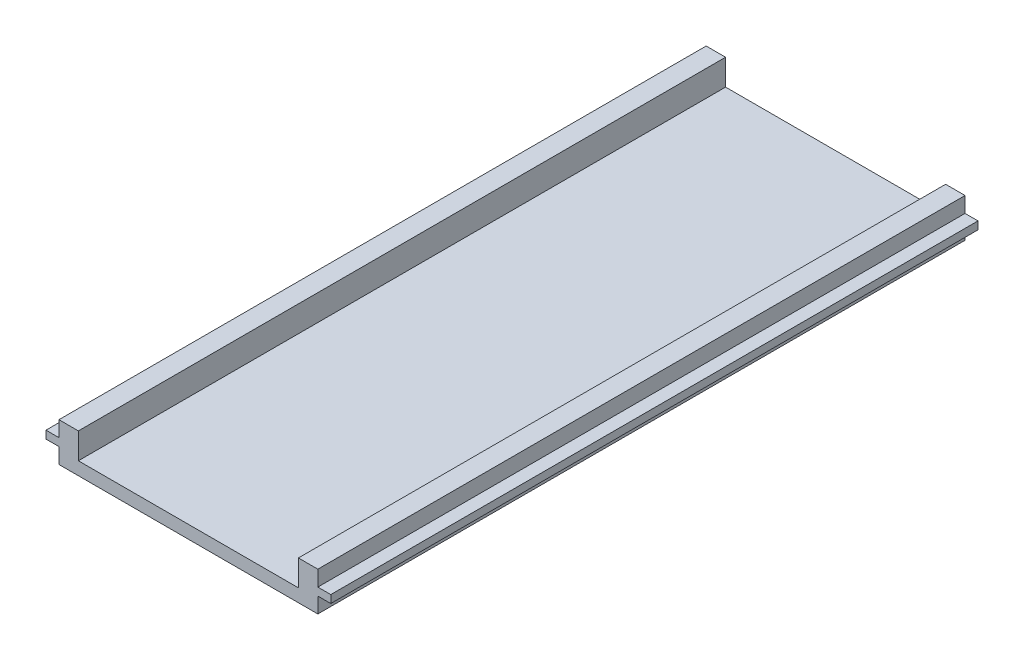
ISO-10303-21;
HEADER;
FILE_DESCRIPTION(('STEP AP214'),'2;1');
FILE_NAME('part.step','',(''),(''),'','','');
FILE_SCHEMA(('AUTOMOTIVE_DESIGN { 1 0 10303 214 1 1 1 1 }'));
ENDSEC;
DATA;
#1=APPLICATION_CONTEXT('core data for automotive mechanical design processes');
#2=APPLICATION_PROTOCOL_DEFINITION('international standard','automotive_design',2000,#1);
#3=PRODUCT_CONTEXT('',#1,'mechanical');
#4=PRODUCT('Part','Part','',(#3));
#5=PRODUCT_RELATED_PRODUCT_CATEGORY('part','',(#4));
#6=PRODUCT_DEFINITION_FORMATION('','',#4);
#7=PRODUCT_DEFINITION_CONTEXT('part definition',#1,'design');
#8=PRODUCT_DEFINITION('design','',#6,#7);
#9=PRODUCT_DEFINITION_SHAPE('','',#8);
#10=(LENGTH_UNIT() NAMED_UNIT(*) SI_UNIT(.MILLI.,.METRE.));
#11=(NAMED_UNIT(*) PLANE_ANGLE_UNIT() SI_UNIT($,.RADIAN.));
#12=(NAMED_UNIT(*) SI_UNIT($,.STERADIAN.) SOLID_ANGLE_UNIT());
#13=UNCERTAINTY_MEASURE_WITH_UNIT(LENGTH_MEASURE(1.E-05),#10,'distance_accuracy_value','');
#14=(GEOMETRIC_REPRESENTATION_CONTEXT(3) GLOBAL_UNCERTAINTY_ASSIGNED_CONTEXT((#13)) GLOBAL_UNIT_ASSIGNED_CONTEXT((#10,
#11,#12)) REPRESENTATION_CONTEXT('',''));
#15=CARTESIAN_POINT('',(0.,0.,0.));
#16=DIRECTION('',(0.,0.,1.));
#17=DIRECTION('',(1.,0.,0.));
#18=AXIS2_PLACEMENT_3D('',#15,#16,#17);
#19=CARTESIAN_POINT('',(4.73196112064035,0.,50.));
#20=DIRECTION('',(1.,0.,0.));
#21=DIRECTION('',(0.,0.,-1.));
#22=AXIS2_PLACEMENT_3D('',#19,#20,#21);
#23=PLANE('',#22);
#24=DIRECTION('',(0.,-1.,0.));
#25=VECTOR('',#24,1.);
#26=CARTESIAN_POINT('',(4.73196112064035,0.,0.));
#27=LINE('',#26,#25);
#28=CARTESIAN_POINT('',(4.73196112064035,1.2,0.));
#29=VERTEX_POINT('',#28);
#30=CARTESIAN_POINT('',(4.73196112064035,0.,0.));
#31=VERTEX_POINT('',#30);
#32=EDGE_CURVE('E179',#29,#31,#27,.T.);
#33=ORIENTED_EDGE('',*,*,#32,.T.);
#34=DIRECTION('',(0.,0.,-1.));
#35=VECTOR('',#34,1.);
#36=CARTESIAN_POINT('',(4.73196112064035,0.,50.));
#37=LINE('',#36,#35);
#38=CARTESIAN_POINT('',(4.73196112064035,0.,50.));
#39=VERTEX_POINT('',#38);
#40=EDGE_CURVE('E11',#39,#31,#37,.T.);
#41=ORIENTED_EDGE('',*,*,#40,.F.);
#42=DIRECTION('',(0.,-1.,0.));
#43=VECTOR('',#42,1.);
#44=CARTESIAN_POINT('',(4.73196112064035,0.,50.));
#45=LINE('',#44,#43);
#46=CARTESIAN_POINT('',(4.73196112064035,1.2,50.));
#47=VERTEX_POINT('',#46);
#48=EDGE_CURVE('E209',#47,#39,#45,.T.);
#49=ORIENTED_EDGE('',*,*,#48,.F.);
#50=DIRECTION('',(0.,0.,-1.));
#51=VECTOR('',#50,1.);
#52=CARTESIAN_POINT('',(4.73196112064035,1.2,50.));
#53=LINE('',#52,#51);
#54=EDGE_CURVE('E175',#47,#29,#53,.T.);
#55=ORIENTED_EDGE('',*,*,#54,.T.);
#56=EDGE_LOOP('',(#33,#41,#49,#55));
#57=FACE_BOUND('',#56,.T.);
#58=ADVANCED_FACE('F35',(#57),#23,.F.);
#59=CARTESIAN_POINT('',(4.73196112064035,0.,50.));
#60=DIRECTION('',(0.,1.,0.));
#61=DIRECTION('',(0.,0.,1.));
#62=AXIS2_PLACEMENT_3D('',#59,#60,#61);
#63=PLANE('',#62);
#64=DIRECTION('',(1.,0.,0.));
#65=VECTOR('',#64,1.);
#66=CARTESIAN_POINT('',(4.73196112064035,0.,0.));
#67=LINE('',#66,#65);
#68=CARTESIAN_POINT('',(24.7319611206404,0.,0.));
#69=VERTEX_POINT('',#68);
#70=EDGE_CURVE('E182',#31,#69,#67,.T.);
#71=ORIENTED_EDGE('',*,*,#70,.T.);
#72=DIRECTION('',(0.,0.,-1.));
#73=VECTOR('',#72,1.);
#74=CARTESIAN_POINT('',(24.7319611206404,0.,50.));
#75=LINE('',#74,#73);
#76=CARTESIAN_POINT('',(24.7319611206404,0.,50.));
#77=VERTEX_POINT('',#76);
#78=EDGE_CURVE('E43',#77,#69,#75,.T.);
#79=ORIENTED_EDGE('',*,*,#78,.F.);
#80=DIRECTION('',(1.,0.,0.));
#81=VECTOR('',#80,1.);
#82=CARTESIAN_POINT('',(4.73196112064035,0.,50.));
#83=LINE('',#82,#81);
#84=EDGE_CURVE('E118',#39,#77,#83,.T.);
#85=ORIENTED_EDGE('',*,*,#84,.F.);
#86=ORIENTED_EDGE('',*,*,#40,.T.);
#87=EDGE_LOOP('',(#71,#79,#85,#86));
#88=FACE_BOUND('',#87,.T.);
#89=ADVANCED_FACE('F307',(#88),#63,.F.);
#90=CARTESIAN_POINT('',(24.7319611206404,0.,50.));
#91=DIRECTION('',(-1.,0.,0.));
#92=DIRECTION('',(0.,0.,1.));
#93=AXIS2_PLACEMENT_3D('',#90,#91,#92);
#94=PLANE('',#93);
#95=DIRECTION('',(0.,1.,0.));
#96=VECTOR('',#95,1.);
#97=CARTESIAN_POINT('',(24.7319611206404,0.,0.));
#98=LINE('',#97,#96);
#99=CARTESIAN_POINT('',(24.7319611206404,1.2,0.));
#100=VERTEX_POINT('',#99);
#101=EDGE_CURVE('E184',#69,#100,#98,.T.);
#102=ORIENTED_EDGE('',*,*,#101,.T.);
#103=DIRECTION('',(0.,0.,-1.));
#104=VECTOR('',#103,1.);
#105=CARTESIAN_POINT('',(24.7319611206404,1.2,50.));
#106=LINE('',#105,#104);
#107=CARTESIAN_POINT('',(24.7319611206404,1.2,50.));
#108=VERTEX_POINT('',#107);
#109=EDGE_CURVE('E240',#108,#100,#106,.T.);
#110=ORIENTED_EDGE('',*,*,#109,.F.);
#111=DIRECTION('',(0.,1.,0.));
#112=VECTOR('',#111,1.);
#113=CARTESIAN_POINT('',(24.7319611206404,0.,50.));
#114=LINE('',#113,#112);
#115=EDGE_CURVE('E248',#77,#108,#114,.T.);
#116=ORIENTED_EDGE('',*,*,#115,.F.);
#117=ORIENTED_EDGE('',*,*,#78,.T.);
#118=EDGE_LOOP('',(#102,#110,#116,#117));
#119=FACE_BOUND('',#118,.T.);
#120=ADVANCED_FACE('F246',(#119),#94,.F.);
#121=CARTESIAN_POINT('',(24.7319611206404,1.2,50.));
#122=DIRECTION('',(0.,1.,0.));
#123=DIRECTION('',(0.,0.,1.));
#124=AXIS2_PLACEMENT_3D('',#121,#122,#123);
#125=PLANE('',#124);
#126=DIRECTION('',(1.,0.,0.));
#127=VECTOR('',#126,1.);
#128=CARTESIAN_POINT('',(24.7319611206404,1.2,0.));
#129=LINE('',#128,#127);
#130=CARTESIAN_POINT('',(25.7319611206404,1.2,0.));
#131=VERTEX_POINT('',#130);
#132=EDGE_CURVE('E186',#100,#131,#129,.T.);
#133=ORIENTED_EDGE('',*,*,#132,.T.);
#134=DIRECTION('',(0.,0.,-1.));
#135=VECTOR('',#134,1.);
#136=CARTESIAN_POINT('',(25.7319611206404,1.2,50.));
#137=LINE('',#136,#135);
#138=CARTESIAN_POINT('',(25.7319611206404,1.2,50.));
#139=VERTEX_POINT('',#138);
#140=EDGE_CURVE('E237',#139,#131,#137,.T.);
#141=ORIENTED_EDGE('',*,*,#140,.F.);
#142=DIRECTION('',(1.,0.,0.));
#143=VECTOR('',#142,1.);
#144=CARTESIAN_POINT('',(24.7319611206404,1.2,50.));
#145=LINE('',#144,#143);
#146=EDGE_CURVE('E266',#108,#139,#145,.T.);
#147=ORIENTED_EDGE('',*,*,#146,.F.);
#148=ORIENTED_EDGE('',*,*,#109,.T.);
#149=EDGE_LOOP('',(#133,#141,#147,#148));
#150=FACE_BOUND('',#149,.T.);
#151=ADVANCED_FACE('F257',(#150),#125,.F.);
#152=CARTESIAN_POINT('',(25.7319611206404,1.2,50.));
#153=DIRECTION('',(-1.,0.,0.));
#154=DIRECTION('',(0.,0.,1.));
#155=AXIS2_PLACEMENT_3D('',#152,#153,#154);
#156=PLANE('',#155);
#157=DIRECTION('',(0.,1.,0.));
#158=VECTOR('',#157,1.);
#159=CARTESIAN_POINT('',(25.7319611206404,1.2,0.));
#160=LINE('',#159,#158);
#161=CARTESIAN_POINT('',(25.7319611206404,1.8,0.));
#162=VERTEX_POINT('',#161);
#163=EDGE_CURVE('E188',#131,#162,#160,.T.);
#164=ORIENTED_EDGE('',*,*,#163,.T.);
#165=DIRECTION('',(0.,0.,-1.));
#166=VECTOR('',#165,1.);
#167=CARTESIAN_POINT('',(25.7319611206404,1.8,50.));
#168=LINE('',#167,#166);
#169=CARTESIAN_POINT('',(25.7319611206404,1.8,50.));
#170=VERTEX_POINT('',#169);
#171=EDGE_CURVE('E234',#170,#162,#168,.T.);
#172=ORIENTED_EDGE('',*,*,#171,.F.);
#173=DIRECTION('',(0.,1.,0.));
#174=VECTOR('',#173,1.);
#175=CARTESIAN_POINT('',(25.7319611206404,1.2,50.));
#176=LINE('',#175,#174);
#177=EDGE_CURVE('E263',#139,#170,#176,.T.);
#178=ORIENTED_EDGE('',*,*,#177,.F.);
#179=ORIENTED_EDGE('',*,*,#140,.T.);
#180=EDGE_LOOP('',(#164,#172,#178,#179));
#181=FACE_BOUND('',#180,.T.);
#182=ADVANCED_FACE('F261',(#181),#156,.F.);
#183=CARTESIAN_POINT('',(25.7319611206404,1.8,50.));
#184=DIRECTION('',(0.,-1.,0.));
#185=DIRECTION('',(1.,0.,0.));
#186=AXIS2_PLACEMENT_3D('',#183,#184,#185);
#187=PLANE('',#186);
#188=DIRECTION('',(-1.,0.,0.));
#189=VECTOR('',#188,1.);
#190=CARTESIAN_POINT('',(25.7319611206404,1.8,0.));
#191=LINE('',#190,#189);
#192=CARTESIAN_POINT('',(24.7319611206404,1.8,0.));
#193=VERTEX_POINT('',#192);
#194=EDGE_CURVE('E190',#162,#193,#191,.T.);
#195=ORIENTED_EDGE('',*,*,#194,.T.);
#196=DIRECTION('',(0.,0.,-1.));
#197=VECTOR('',#196,1.);
#198=CARTESIAN_POINT('',(24.7319611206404,1.8,50.));
#199=LINE('',#198,#197);
#200=CARTESIAN_POINT('',(24.7319611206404,1.8,50.));
#201=VERTEX_POINT('',#200);
#202=EDGE_CURVE('E231',#201,#193,#199,.T.);
#203=ORIENTED_EDGE('',*,*,#202,.F.);
#204=DIRECTION('',(-1.,0.,0.));
#205=VECTOR('',#204,1.);
#206=CARTESIAN_POINT('',(25.7319611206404,1.8,50.));
#207=LINE('',#206,#205);
#208=EDGE_CURVE('E265',#170,#201,#207,.T.);
#209=ORIENTED_EDGE('',*,*,#208,.F.);
#210=ORIENTED_EDGE('',*,*,#171,.T.);
#211=EDGE_LOOP('',(#195,#203,#209,#210));
#212=FACE_BOUND('',#211,.T.);
#213=ADVANCED_FACE('F320',(#212),#187,.F.);
#214=CARTESIAN_POINT('',(24.7319611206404,1.8,50.));
#215=DIRECTION('',(-1.,0.,0.));
#216=DIRECTION('',(0.,0.,1.));
#217=AXIS2_PLACEMENT_3D('',#214,#215,#216);
#218=PLANE('',#217);
#219=DIRECTION('',(0.,1.,0.));
#220=VECTOR('',#219,1.);
#221=CARTESIAN_POINT('',(24.7319611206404,1.8,0.));
#222=LINE('',#221,#220);
#223=CARTESIAN_POINT('',(24.7319611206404,3.,0.));
#224=VERTEX_POINT('',#223);
#225=EDGE_CURVE('E192',#193,#224,#222,.T.);
#226=ORIENTED_EDGE('',*,*,#225,.T.);
#227=DIRECTION('',(0.,0.,-1.));
#228=VECTOR('',#227,1.);
#229=CARTESIAN_POINT('',(24.7319611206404,3.,50.));
#230=LINE('',#229,#228);
#231=CARTESIAN_POINT('',(24.7319611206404,3.,50.));
#232=VERTEX_POINT('',#231);
#233=EDGE_CURVE('E228',#232,#224,#230,.T.);
#234=ORIENTED_EDGE('',*,*,#233,.F.);
#235=DIRECTION('',(0.,1.,0.));
#236=VECTOR('',#235,1.);
#237=CARTESIAN_POINT('',(24.7319611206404,1.8,50.));
#238=LINE('',#237,#236);
#239=EDGE_CURVE('E268',#201,#232,#238,.T.);
#240=ORIENTED_EDGE('',*,*,#239,.F.);
#241=ORIENTED_EDGE('',*,*,#202,.T.);
#242=EDGE_LOOP('',(#226,#234,#240,#241));
#243=FACE_BOUND('',#242,.T.);
#244=ADVANCED_FACE('F323',(#243),#218,.F.);
#245=CARTESIAN_POINT('',(23.2319611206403,3.,50.));
#246=DIRECTION('',(0.,-1.,0.));
#247=DIRECTION('',(0.,0.,-1.));
#248=AXIS2_PLACEMENT_3D('',#245,#246,#247);
#249=PLANE('',#248);
#250=DIRECTION('',(-1.,0.,0.));
#251=VECTOR('',#250,1.);
#252=CARTESIAN_POINT('',(23.2319611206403,3.,0.));
#253=LINE('',#252,#251);
#254=CARTESIAN_POINT('',(23.2319611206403,3.,0.));
#255=VERTEX_POINT('',#254);
#256=EDGE_CURVE('E194',#224,#255,#253,.T.);
#257=ORIENTED_EDGE('',*,*,#256,.T.);
#258=DIRECTION('',(0.,0.,-1.));
#259=VECTOR('',#258,1.);
#260=CARTESIAN_POINT('',(23.2319611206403,3.,50.));
#261=LINE('',#260,#259);
#262=CARTESIAN_POINT('',(23.2319611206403,3.,50.));
#263=VERTEX_POINT('',#262);
#264=EDGE_CURVE('E225',#263,#255,#261,.T.);
#265=ORIENTED_EDGE('',*,*,#264,.F.);
#266=DIRECTION('',(-1.,0.,0.));
#267=VECTOR('',#266,1.);
#268=CARTESIAN_POINT('',(23.2319611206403,3.,50.));
#269=LINE('',#268,#267);
#270=EDGE_CURVE('E274',#232,#263,#269,.T.);
#271=ORIENTED_EDGE('',*,*,#270,.F.);
#272=ORIENTED_EDGE('',*,*,#233,.T.);
#273=EDGE_LOOP('',(#257,#265,#271,#272));
#274=FACE_BOUND('',#273,.T.);
#275=ADVANCED_FACE('F327',(#274),#249,.F.);
#276=CARTESIAN_POINT('',(23.2319611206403,0.999999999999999,50.));
#277=DIRECTION('',(1.,0.,0.));
#278=DIRECTION('',(0.,0.,-1.));
#279=AXIS2_PLACEMENT_3D('',#276,#277,#278);
#280=PLANE('',#279);
#281=DIRECTION('',(0.,-1.,0.));
#282=VECTOR('',#281,1.);
#283=CARTESIAN_POINT('',(23.2319611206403,0.999999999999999,0.));
#284=LINE('',#283,#282);
#285=CARTESIAN_POINT('',(23.2319611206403,0.999999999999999,0.));
#286=VERTEX_POINT('',#285);
#287=EDGE_CURVE('E196',#255,#286,#284,.T.);
#288=ORIENTED_EDGE('',*,*,#287,.T.);
#289=DIRECTION('',(0.,0.,-1.));
#290=VECTOR('',#289,1.);
#291=CARTESIAN_POINT('',(23.2319611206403,0.999999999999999,50.));
#292=LINE('',#291,#290);
#293=CARTESIAN_POINT('',(23.2319611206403,0.999999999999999,50.));
#294=VERTEX_POINT('',#293);
#295=EDGE_CURVE('E222',#294,#286,#292,.T.);
#296=ORIENTED_EDGE('',*,*,#295,.F.);
#297=DIRECTION('',(0.,-1.,0.));
#298=VECTOR('',#297,1.);
#299=CARTESIAN_POINT('',(23.2319611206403,0.999999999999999,50.));
#300=LINE('',#299,#298);
#301=EDGE_CURVE('E276',#263,#294,#300,.T.);
#302=ORIENTED_EDGE('',*,*,#301,.F.);
#303=ORIENTED_EDGE('',*,*,#264,.T.);
#304=EDGE_LOOP('',(#288,#296,#302,#303));
#305=FACE_BOUND('',#304,.T.);
#306=ADVANCED_FACE('F331',(#305),#280,.F.);
#307=CARTESIAN_POINT('',(6.23196112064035,0.999999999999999,50.));
#308=DIRECTION('',(0.,-1.,0.));
#309=DIRECTION('',(0.,0.,-1.));
#310=AXIS2_PLACEMENT_3D('',#307,#308,#309);
#311=PLANE('',#310);
#312=DIRECTION('',(-1.,0.,0.));
#313=VECTOR('',#312,1.);
#314=CARTESIAN_POINT('',(6.23196112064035,0.999999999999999,0.));
#315=LINE('',#314,#313);
#316=CARTESIAN_POINT('',(6.23196112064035,0.999999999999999,0.));
#317=VERTEX_POINT('',#316);
#318=EDGE_CURVE('E198',#286,#317,#315,.T.);
#319=ORIENTED_EDGE('',*,*,#318,.T.);
#320=DIRECTION('',(0.,0.,-1.));
#321=VECTOR('',#320,1.);
#322=CARTESIAN_POINT('',(6.23196112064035,0.999999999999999,50.));
#323=LINE('',#322,#321);
#324=CARTESIAN_POINT('',(6.23196112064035,0.999999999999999,50.));
#325=VERTEX_POINT('',#324);
#326=EDGE_CURVE('E219',#325,#317,#323,.T.);
#327=ORIENTED_EDGE('',*,*,#326,.F.);
#328=DIRECTION('',(-1.,0.,0.));
#329=VECTOR('',#328,1.);
#330=CARTESIAN_POINT('',(6.23196112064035,0.999999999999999,50.));
#331=LINE('',#330,#329);
#332=EDGE_CURVE('E278',#294,#325,#331,.T.);
#333=ORIENTED_EDGE('',*,*,#332,.F.);
#334=ORIENTED_EDGE('',*,*,#295,.T.);
#335=EDGE_LOOP('',(#319,#327,#333,#334));
#336=FACE_BOUND('',#335,.T.);
#337=ADVANCED_FACE('F335',(#336),#311,.F.);
#338=CARTESIAN_POINT('',(6.23196112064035,3.,50.));
#339=DIRECTION('',(-1.,0.,0.));
#340=DIRECTION('',(0.,-1.,0.));
#341=AXIS2_PLACEMENT_3D('',#338,#339,#340);
#342=PLANE('',#341);
#343=DIRECTION('',(0.,1.,0.));
#344=VECTOR('',#343,1.);
#345=CARTESIAN_POINT('',(6.23196112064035,3.,0.));
#346=LINE('',#345,#344);
#347=CARTESIAN_POINT('',(6.23196112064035,3.,0.));
#348=VERTEX_POINT('',#347);
#349=EDGE_CURVE('E200',#317,#348,#346,.T.);
#350=ORIENTED_EDGE('',*,*,#349,.T.);
#351=DIRECTION('',(0.,0.,-1.));
#352=VECTOR('',#351,1.);
#353=CARTESIAN_POINT('',(6.23196112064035,3.,50.));
#354=LINE('',#353,#352);
#355=CARTESIAN_POINT('',(6.23196112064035,3.,50.));
#356=VERTEX_POINT('',#355);
#357=EDGE_CURVE('E216',#356,#348,#354,.T.);
#358=ORIENTED_EDGE('',*,*,#357,.F.);
#359=DIRECTION('',(0.,1.,0.));
#360=VECTOR('',#359,1.);
#361=CARTESIAN_POINT('',(6.23196112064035,3.,50.));
#362=LINE('',#361,#360);
#363=EDGE_CURVE('E280',#325,#356,#362,.T.);
#364=ORIENTED_EDGE('',*,*,#363,.F.);
#365=ORIENTED_EDGE('',*,*,#326,.T.);
#366=EDGE_LOOP('',(#350,#358,#364,#365));
#367=FACE_BOUND('',#366,.T.);
#368=ADVANCED_FACE('F339',(#367),#342,.F.);
#369=CARTESIAN_POINT('',(4.73196112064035,3.,50.));
#370=DIRECTION('',(0.,-1.,0.));
#371=DIRECTION('',(0.,0.,-1.));
#372=AXIS2_PLACEMENT_3D('',#369,#370,#371);
#373=PLANE('',#372);
#374=DIRECTION('',(-1.,0.,0.));
#375=VECTOR('',#374,1.);
#376=CARTESIAN_POINT('',(4.73196112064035,3.,0.));
#377=LINE('',#376,#375);
#378=CARTESIAN_POINT('',(4.73196112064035,3.,0.));
#379=VERTEX_POINT('',#378);
#380=EDGE_CURVE('E202',#348,#379,#377,.T.);
#381=ORIENTED_EDGE('',*,*,#380,.T.);
#382=DIRECTION('',(0.,0.,-1.));
#383=VECTOR('',#382,1.);
#384=CARTESIAN_POINT('',(4.73196112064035,3.,50.));
#385=LINE('',#384,#383);
#386=CARTESIAN_POINT('',(4.73196112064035,3.,50.));
#387=VERTEX_POINT('',#386);
#388=EDGE_CURVE('E213',#387,#379,#385,.T.);
#389=ORIENTED_EDGE('',*,*,#388,.F.);
#390=DIRECTION('',(-1.,0.,0.));
#391=VECTOR('',#390,1.);
#392=CARTESIAN_POINT('',(4.73196112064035,3.,50.));
#393=LINE('',#392,#391);
#394=EDGE_CURVE('E282',#356,#387,#393,.T.);
#395=ORIENTED_EDGE('',*,*,#394,.F.);
#396=ORIENTED_EDGE('',*,*,#357,.T.);
#397=EDGE_LOOP('',(#381,#389,#395,#396));
#398=FACE_BOUND('',#397,.T.);
#399=ADVANCED_FACE('F288',(#398),#373,.F.);
#400=CARTESIAN_POINT('',(4.73196112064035,1.8,50.));
#401=DIRECTION('',(1.,0.,0.));
#402=DIRECTION('',(0.,0.,-1.));
#403=AXIS2_PLACEMENT_3D('',#400,#401,#402);
#404=PLANE('',#403);
#405=DIRECTION('',(0.,-1.,0.));
#406=VECTOR('',#405,1.);
#407=CARTESIAN_POINT('',(4.73196112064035,1.8,0.));
#408=LINE('',#407,#406);
#409=CARTESIAN_POINT('',(4.73196112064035,1.8,0.));
#410=VERTEX_POINT('',#409);
#411=EDGE_CURVE('E204',#379,#410,#408,.T.);
#412=ORIENTED_EDGE('',*,*,#411,.T.);
#413=DIRECTION('',(0.,0.,-1.));
#414=VECTOR('',#413,1.);
#415=CARTESIAN_POINT('',(4.73196112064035,1.8,50.));
#416=LINE('',#415,#414);
#417=CARTESIAN_POINT('',(4.73196112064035,1.8,50.));
#418=VERTEX_POINT('',#417);
#419=EDGE_CURVE('E170',#418,#410,#416,.T.);
#420=ORIENTED_EDGE('',*,*,#419,.F.);
#421=DIRECTION('',(0.,-1.,0.));
#422=VECTOR('',#421,1.);
#423=CARTESIAN_POINT('',(4.73196112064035,1.8,50.));
#424=LINE('',#423,#422);
#425=EDGE_CURVE('E161',#387,#418,#424,.T.);
#426=ORIENTED_EDGE('',*,*,#425,.F.);
#427=ORIENTED_EDGE('',*,*,#388,.T.);
#428=EDGE_LOOP('',(#412,#420,#426,#427));
#429=FACE_BOUND('',#428,.T.);
#430=ADVANCED_FACE('F292',(#429),#404,.F.);
#431=CARTESIAN_POINT('',(3.73196112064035,1.8,50.));
#432=DIRECTION('',(0.,-1.,0.));
#433=DIRECTION('',(0.,0.,-1.));
#434=AXIS2_PLACEMENT_3D('',#431,#432,#433);
#435=PLANE('',#434);
#436=DIRECTION('',(-1.,0.,0.));
#437=VECTOR('',#436,1.);
#438=CARTESIAN_POINT('',(3.73196112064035,1.8,0.));
#439=LINE('',#438,#437);
#440=CARTESIAN_POINT('',(3.73196112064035,1.8,0.));
#441=VERTEX_POINT('',#440);
#442=EDGE_CURVE('E169',#410,#441,#439,.T.);
#443=ORIENTED_EDGE('',*,*,#442,.T.);
#444=DIRECTION('',(0.,0.,-1.));
#445=VECTOR('',#444,1.);
#446=CARTESIAN_POINT('',(3.73196112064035,1.8,50.));
#447=LINE('',#446,#445);
#448=CARTESIAN_POINT('',(3.73196112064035,1.8,50.));
#449=VERTEX_POINT('',#448);
#450=EDGE_CURVE('E166',#449,#441,#447,.T.);
#451=ORIENTED_EDGE('',*,*,#450,.F.);
#452=DIRECTION('',(-1.,0.,0.));
#453=VECTOR('',#452,1.);
#454=CARTESIAN_POINT('',(3.73196112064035,1.8,50.));
#455=LINE('',#454,#453);
#456=EDGE_CURVE('E155',#418,#449,#455,.T.);
#457=ORIENTED_EDGE('',*,*,#456,.F.);
#458=ORIENTED_EDGE('',*,*,#419,.T.);
#459=EDGE_LOOP('',(#443,#451,#457,#458));
#460=FACE_BOUND('',#459,.T.);
#461=ADVANCED_FACE('F167',(#460),#435,.F.);
#462=CARTESIAN_POINT('',(3.73196112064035,1.2,50.));
#463=DIRECTION('',(1.,0.,0.));
#464=DIRECTION('',(0.,0.,-1.));
#465=AXIS2_PLACEMENT_3D('',#462,#463,#464);
#466=PLANE('',#465);
#467=DIRECTION('',(0.,-1.,0.));
#468=VECTOR('',#467,1.);
#469=CARTESIAN_POINT('',(3.73196112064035,1.2,0.));
#470=LINE('',#469,#468);
#471=CARTESIAN_POINT('',(3.73196112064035,1.2,0.));
#472=VERTEX_POINT('',#471);
#473=EDGE_CURVE('E104',#441,#472,#470,.T.);
#474=ORIENTED_EDGE('',*,*,#473,.T.);
#475=DIRECTION('',(0.,0.,-1.));
#476=VECTOR('',#475,1.);
#477=CARTESIAN_POINT('',(3.73196112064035,1.2,50.));
#478=LINE('',#477,#476);
#479=CARTESIAN_POINT('',(3.73196112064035,1.2,50.));
#480=VERTEX_POINT('',#479);
#481=EDGE_CURVE('E171',#480,#472,#478,.T.);
#482=ORIENTED_EDGE('',*,*,#481,.F.);
#483=DIRECTION('',(0.,-1.,0.));
#484=VECTOR('',#483,1.);
#485=CARTESIAN_POINT('',(3.73196112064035,1.2,50.));
#486=LINE('',#485,#484);
#487=EDGE_CURVE('E159',#449,#480,#486,.T.);
#488=ORIENTED_EDGE('',*,*,#487,.F.);
#489=ORIENTED_EDGE('',*,*,#450,.T.);
#490=EDGE_LOOP('',(#474,#482,#488,#489));
#491=FACE_BOUND('',#490,.T.);
#492=ADVANCED_FACE('F173',(#491),#466,.F.);
#493=CARTESIAN_POINT('',(4.73196112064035,1.2,50.));
#494=DIRECTION('',(0.,1.,0.));
#495=DIRECTION('',(-1.,0.,0.));
#496=AXIS2_PLACEMENT_3D('',#493,#494,#495);
#497=PLANE('',#496);
#498=DIRECTION('',(1.,0.,0.));
#499=VECTOR('',#498,1.);
#500=CARTESIAN_POINT('',(4.73196112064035,1.2,0.));
#501=LINE('',#500,#499);
#502=EDGE_CURVE('E110',#472,#29,#501,.T.);
#503=ORIENTED_EDGE('',*,*,#502,.T.);
#504=ORIENTED_EDGE('',*,*,#54,.F.);
#505=DIRECTION('',(1.,0.,0.));
#506=VECTOR('',#505,1.);
#507=CARTESIAN_POINT('',(4.73196112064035,1.2,50.));
#508=LINE('',#507,#506);
#509=EDGE_CURVE('E51',#480,#47,#508,.T.);
#510=ORIENTED_EDGE('',*,*,#509,.F.);
#511=ORIENTED_EDGE('',*,*,#481,.T.);
#512=EDGE_LOOP('',(#503,#504,#510,#511));
#513=FACE_BOUND('',#512,.T.);
#514=ADVANCED_FACE('F296',(#513),#497,.F.);
#515=CARTESIAN_POINT('',(0.,0.,50.));
#516=DIRECTION('',(0.,0.,1.));
#517=DIRECTION('',(1.,0.,0.));
#518=AXIS2_PLACEMENT_3D('',#515,#516,#517);
#519=PLANE('',#518);
#520=ORIENTED_EDGE('',*,*,#48,.T.);
#521=ORIENTED_EDGE('',*,*,#84,.T.);
#522=ORIENTED_EDGE('',*,*,#115,.T.);
#523=ORIENTED_EDGE('',*,*,#146,.T.);
#524=ORIENTED_EDGE('',*,*,#177,.T.);
#525=ORIENTED_EDGE('',*,*,#208,.T.);
#526=ORIENTED_EDGE('',*,*,#239,.T.);
#527=ORIENTED_EDGE('',*,*,#270,.T.);
#528=ORIENTED_EDGE('',*,*,#301,.T.);
#529=ORIENTED_EDGE('',*,*,#332,.T.);
#530=ORIENTED_EDGE('',*,*,#363,.T.);
#531=ORIENTED_EDGE('',*,*,#394,.T.);
#532=ORIENTED_EDGE('',*,*,#425,.T.);
#533=ORIENTED_EDGE('',*,*,#456,.T.);
#534=ORIENTED_EDGE('',*,*,#487,.T.);
#535=ORIENTED_EDGE('',*,*,#509,.T.);
#536=EDGE_LOOP('',(#520,#521,#522,#523,#524,#525,#526,#527,#528,#529,#530,#531,#532,#533,#534,#535));
#537=FACE_BOUND('',#536,.T.);
#538=ADVANCED_FACE('F157',(#537),#519,.T.);
#539=CARTESIAN_POINT('',(0.,0.,0.));
#540=DIRECTION('',(0.,0.,1.));
#541=DIRECTION('',(1.,0.,0.));
#542=AXIS2_PLACEMENT_3D('',#539,#540,#541);
#543=PLANE('',#542);
#544=ORIENTED_EDGE('',*,*,#32,.F.);
#545=ORIENTED_EDGE('',*,*,#502,.F.);
#546=ORIENTED_EDGE('',*,*,#473,.F.);
#547=ORIENTED_EDGE('',*,*,#442,.F.);
#548=ORIENTED_EDGE('',*,*,#411,.F.);
#549=ORIENTED_EDGE('',*,*,#380,.F.);
#550=ORIENTED_EDGE('',*,*,#349,.F.);
#551=ORIENTED_EDGE('',*,*,#318,.F.);
#552=ORIENTED_EDGE('',*,*,#287,.F.);
#553=ORIENTED_EDGE('',*,*,#256,.F.);
#554=ORIENTED_EDGE('',*,*,#225,.F.);
#555=ORIENTED_EDGE('',*,*,#194,.F.);
#556=ORIENTED_EDGE('',*,*,#163,.F.);
#557=ORIENTED_EDGE('',*,*,#132,.F.);
#558=ORIENTED_EDGE('',*,*,#101,.F.);
#559=ORIENTED_EDGE('',*,*,#70,.F.);
#560=EDGE_LOOP('',(#544,#545,#546,#547,#548,#549,#550,#551,#552,#553,#554,#555,#556,#557,#558,#559));
#561=FACE_BOUND('',#560,.T.);
#562=ADVANCED_FACE('F252',(#561),#543,.F.);
#563=CLOSED_SHELL('',(#58,#89,#120,#151,#182,#213,#244,#275,#306,#337,#368,#399,#430,#461,#492,
#514,#538,#562));
#564=MANIFOLD_SOLID_BREP('B2',#563);
#565=ADVANCED_BREP_SHAPE_REPRESENTATION('',(#18,#564),#14);
#566=SHAPE_DEFINITION_REPRESENTATION(#9,#565);
ENDSEC;
END-ISO-10303-21;
